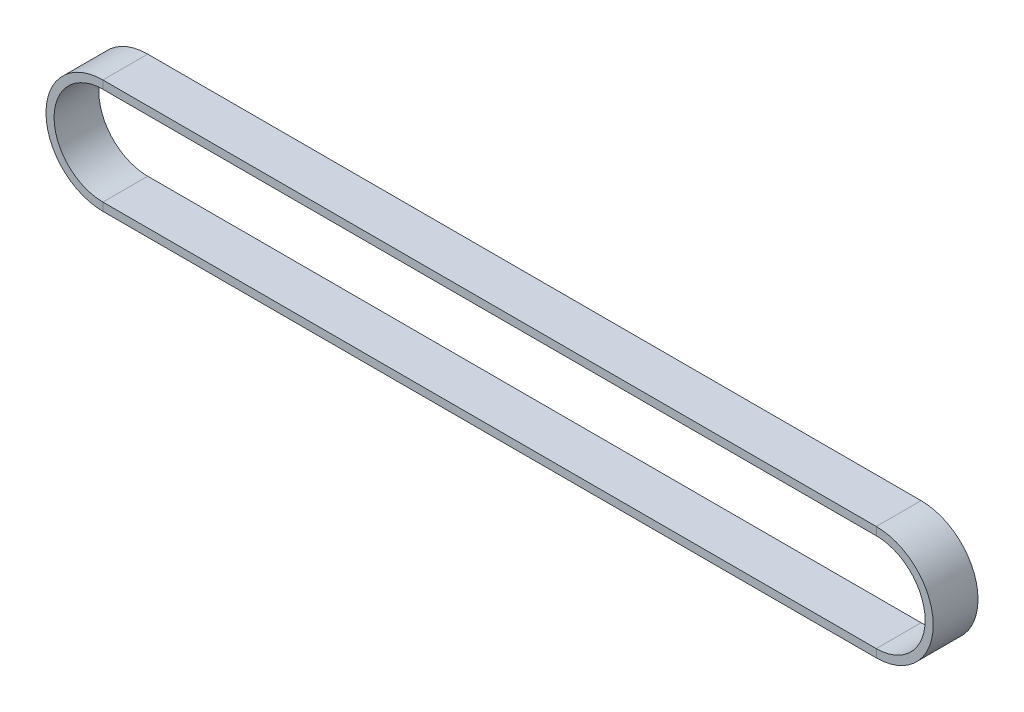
from build123d import *

# Parameters (mm, degrees)
SKETCH3_W = 25
SKETCH3_H = 4.5


with BuildPart() as part:
    # Sweep1: sweep along a path in Sketch2
    with BuildLine(Plane.XY) as sweep1_path:
        Line((0, -29.5), (-431.5, -29.5))
        ThreePointArc((-431.5, -29.5), (-461, 0), (-431.5, 29.5))
        Line((-431.5, 29.5), (0, 29.5))
        ThreePointArc((0, 29.5), (29.5, 0), (0, -29.5))
    # Sketch3 → Sweep1 (sweep)
    with BuildSketch(Plane(origin=(0, 29.5, 0), x_dir=(0, 0, -1), z_dir=(1, 0, 0))):
        Rectangle(SKETCH3_W, SKETCH3_H)
    sweep(path=sweep1_path.line)


solid = part.part
